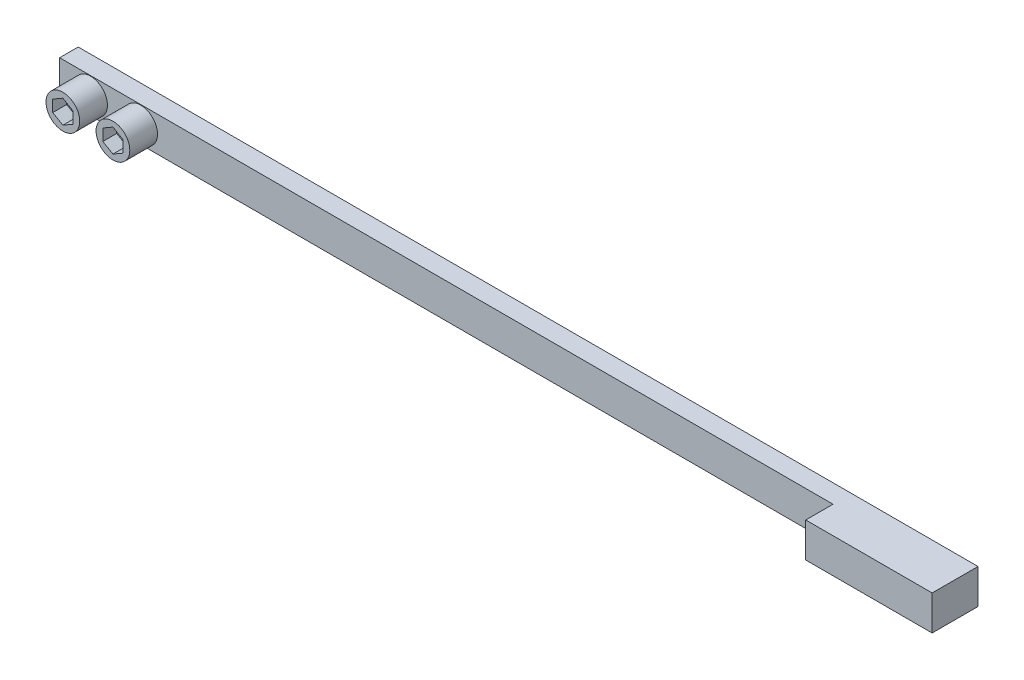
from build123d import *

# Parameters (mm, degrees)
EXTRUDE1_DEPTH     = 3.556
SKETCH2_R          = 1.7272
EXTRUDE2_DEPTH     = 2.8448
CUT_EXTRUDE1_DEPTH = 1.4224
SKETCH4_R          = 1.7272
EXTRUDE3_DEPTH     = 2.8448
CUT_EXTRUDE2_DEPTH = 1.4224


with BuildPart() as part:
    # Sketch1 → Extrude1 (new body)
    with BuildSketch(Plane(origin=(0, -1.778, 0), x_dir=(-1, 0, 0), z_dir=(0, 1, 0))):
        Polygon((46.101, -0.9525), (46.101, 0.9525), (-33.147, 0.9525), (-33.147, 3.7465), (-46.101, 3.7465), (-46.101, -0.9525), align=None)
    extrude(amount=EXTRUDE1_DEPTH)

    # Sketch2 → Extrude2 (add)
    with BuildSketch(Plane.XY.offset(0.9525)):
        with Locations(Location((-42.926, 0, 0), (0, 0, 180))):
            Circle(SKETCH2_R)
    extrude(amount=EXTRUDE2_DEPTH)

    # Sketch3 → Cut-Extrude1 (cut)
    with BuildSketch(Plane.XY.offset(3.7973)):
        Polygon((-43.96232, 0.598319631), (-43.96232, -0.598319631), (-42.926, -1.196639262), (-41.88968, -0.598319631), (-41.88968, 0.598319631), (-42.926, 1.196639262), align=None)
    extrude(amount=-CUT_EXTRUDE1_DEPTH, mode=Mode.SUBTRACT)

    # Sketch4 → Extrude3 (add)
    with BuildSketch(Plane.XY.offset(0.9525)):
        with Locations(Location((-37.7952, 0, 0), (0, 0, 180))):
            Circle(SKETCH4_R)
    extrude(amount=EXTRUDE3_DEPTH)

    # Sketch5 → Cut-Extrude2 (cut)
    with BuildSketch(Plane.XY.offset(3.7973)):
        Polygon((-38.83152, 0.598319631), (-38.83152, -0.598319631), (-37.7952, -1.196639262), (-36.75888, -0.598319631), (-36.75888, 0.598319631), (-37.7952, 1.196639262), align=None)
    extrude(amount=-CUT_EXTRUDE2_DEPTH, mode=Mode.SUBTRACT)


solid = part.part
